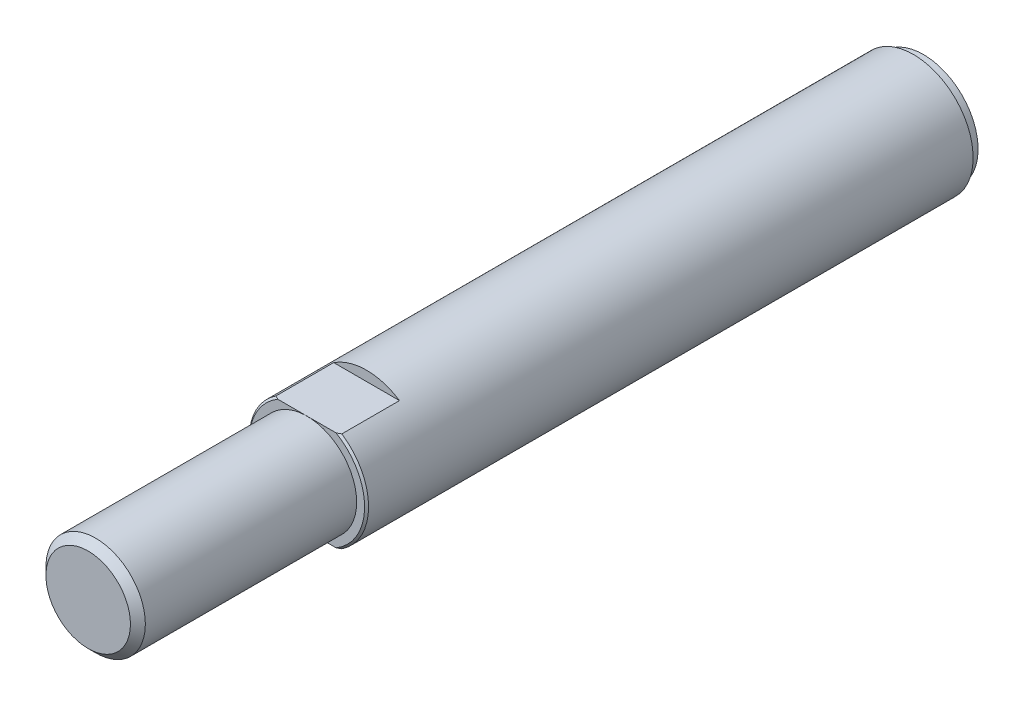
ISO-10303-21;
HEADER;
FILE_DESCRIPTION(('STEP AP214'),'2;1');
FILE_NAME('part.step','',(''),(''),'','','');
FILE_SCHEMA(('AUTOMOTIVE_DESIGN { 1 0 10303 214 1 1 1 1 }'));
ENDSEC;
DATA;
#1=APPLICATION_CONTEXT('core data for automotive mechanical design processes');
#2=APPLICATION_PROTOCOL_DEFINITION('international standard','automotive_design',2000,#1);
#3=PRODUCT_CONTEXT('',#1,'mechanical');
#4=PRODUCT('Part','Part','',(#3));
#5=PRODUCT_RELATED_PRODUCT_CATEGORY('part','',(#4));
#6=PRODUCT_DEFINITION_FORMATION('','',#4);
#7=PRODUCT_DEFINITION_CONTEXT('part definition',#1,'design');
#8=PRODUCT_DEFINITION('design','',#6,#7);
#9=PRODUCT_DEFINITION_SHAPE('','',#8);
#10=(LENGTH_UNIT() NAMED_UNIT(*) SI_UNIT(.MILLI.,.METRE.));
#11=(NAMED_UNIT(*) PLANE_ANGLE_UNIT() SI_UNIT($,.RADIAN.));
#12=(NAMED_UNIT(*) SI_UNIT($,.STERADIAN.) SOLID_ANGLE_UNIT());
#13=UNCERTAINTY_MEASURE_WITH_UNIT(LENGTH_MEASURE(1.E-05),#10,'distance_accuracy_value','');
#14=(GEOMETRIC_REPRESENTATION_CONTEXT(3) GLOBAL_UNCERTAINTY_ASSIGNED_CONTEXT((#13)) GLOBAL_UNIT_ASSIGNED_CONTEXT((#10,
#11,#12)) REPRESENTATION_CONTEXT('',''));
#15=CARTESIAN_POINT('',(0.,0.,0.));
#16=DIRECTION('',(0.,0.,1.));
#17=DIRECTION('',(1.,0.,0.));
#18=AXIS2_PLACEMENT_3D('',#15,#16,#17);
#19=CARTESIAN_POINT('',(0.,0.,84.));
#20=DIRECTION('',(0.,0.,-1.));
#21=DIRECTION('',(-1.,0.,0.));
#22=AXIS2_PLACEMENT_3D('',#19,#20,#21);
#23=CYLINDRICAL_SURFACE('',#22,6.);
#24=CARTESIAN_POINT('',(0.,0.,1.));
#25=DIRECTION('',(0.,0.,-1.));
#26=DIRECTION('',(-1.,0.,0.));
#27=AXIS2_PLACEMENT_3D('',#24,#25,#26);
#28=CIRCLE('',#27,6.);
#29=CARTESIAN_POINT('',(-6.,0.,1.));
#30=VERTEX_POINT('',#29);
#31=EDGE_CURVE('E126',#30,#30,#28,.T.);
#32=ORIENTED_EDGE('',*,*,#31,.F.);
#33=EDGE_LOOP('',(#32));
#34=FACE_BOUND('',#33,.T.);
#35=DIRECTION('',(0.,0.,-1.));
#36=VECTOR('',#35,1.);
#37=CARTESIAN_POINT('',(-3.30907464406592,-5.005,84.));
#38=LINE('',#37,#36);
#39=CARTESIAN_POINT('',(-3.30907464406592,-5.005,61.8000000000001));
#40=VERTEX_POINT('',#39);
#41=CARTESIAN_POINT('',(-3.30907464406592,-5.005,56.));
#42=VERTEX_POINT('',#41);
#43=EDGE_CURVE('E197',#40,#42,#38,.T.);
#44=ORIENTED_EDGE('',*,*,#43,.F.);
#45=CARTESIAN_POINT('',(0.,0.,61.8000000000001));
#46=DIRECTION('',(0.,0.,1.));
#47=DIRECTION('',(1.,0.,0.));
#48=AXIS2_PLACEMENT_3D('',#45,#46,#47);
#49=CIRCLE('',#48,6.);
#50=CARTESIAN_POINT('',(-3.30907464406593,5.005,61.8000000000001));
#51=VERTEX_POINT('',#50);
#52=EDGE_CURVE('E128',#40,#51,#49,.F.);
#53=ORIENTED_EDGE('',*,*,#52,.T.);
#54=DIRECTION('',(0.,0.,-1.));
#55=VECTOR('',#54,1.);
#56=CARTESIAN_POINT('',(-3.30907464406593,5.005,84.));
#57=LINE('',#56,#55);
#58=CARTESIAN_POINT('',(-3.30907464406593,5.005,56.));
#59=VERTEX_POINT('',#58);
#60=EDGE_CURVE('E55',#59,#51,#57,.F.);
#61=ORIENTED_EDGE('',*,*,#60,.F.);
#62=CARTESIAN_POINT('',(0.,0.,56.));
#63=DIRECTION('',(0.,0.,1.));
#64=DIRECTION('',(1.,0.,0.));
#65=AXIS2_PLACEMENT_3D('',#62,#63,#64);
#66=CIRCLE('',#65,6.);
#67=CARTESIAN_POINT('',(3.30907464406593,5.005,56.));
#68=VERTEX_POINT('',#67);
#69=EDGE_CURVE('E44',#68,#59,#66,.T.);
#70=ORIENTED_EDGE('',*,*,#69,.F.);
#71=DIRECTION('',(0.,0.,-1.));
#72=VECTOR('',#71,1.);
#73=CARTESIAN_POINT('',(3.30907464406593,5.005,84.));
#74=LINE('',#73,#72);
#75=CARTESIAN_POINT('',(3.30907464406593,5.005,61.8000000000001));
#76=VERTEX_POINT('',#75);
#77=EDGE_CURVE('E206',#76,#68,#74,.T.);
#78=ORIENTED_EDGE('',*,*,#77,.F.);
#79=CARTESIAN_POINT('',(3.30907464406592,-5.005,61.8000000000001));
#80=VERTEX_POINT('',#79);
#81=EDGE_CURVE('E113',#76,#80,#49,.F.);
#82=ORIENTED_EDGE('',*,*,#81,.T.);
#83=DIRECTION('',(0.,0.,-1.));
#84=VECTOR('',#83,1.);
#85=CARTESIAN_POINT('',(3.30907464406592,-5.005,84.));
#86=LINE('',#85,#84);
#87=CARTESIAN_POINT('',(3.30907464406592,-5.005,56.));
#88=VERTEX_POINT('',#87);
#89=EDGE_CURVE('E63',#88,#80,#86,.F.);
#90=ORIENTED_EDGE('',*,*,#89,.F.);
#91=EDGE_CURVE('E12',#42,#88,#66,.T.);
#92=ORIENTED_EDGE('',*,*,#91,.F.);
#93=EDGE_LOOP('',(#44,#53,#61,#70,#78,#82,#90,#92));
#94=FACE_BOUND('',#93,.T.);
#95=ADVANCED_FACE('F40',(#34,#94),#23,.T.);
#96=CARTESIAN_POINT('',(0.,0.,62.));
#97=DIRECTION('',(0.,0.,1.));
#98=DIRECTION('',(1.,0.,0.));
#99=AXIS2_PLACEMENT_3D('',#96,#97,#98);
#100=PLANE('',#99);
#101=CARTESIAN_POINT('',(0.,0.,62.));
#102=DIRECTION('',(0.,0.,1.));
#103=DIRECTION('',(1.,0.,0.));
#104=AXIS2_PLACEMENT_3D('',#101,#102,#103);
#105=CIRCLE('',#104,5.);
#106=CARTESIAN_POINT('',(5.,0.,62.));
#107=VERTEX_POINT('',#106);
#108=EDGE_CURVE('E119',#107,#107,#105,.T.);
#109=ORIENTED_EDGE('',*,*,#108,.F.);
#110=EDGE_LOOP('',(#109));
#111=FACE_BOUND('',#110,.T.);
#112=CARTESIAN_POINT('',(0.,0.,62.));
#113=DIRECTION('',(0.,0.,1.));
#114=DIRECTION('',(1.,0.,0.));
#115=AXIS2_PLACEMENT_3D('',#112,#113,#114);
#116=CIRCLE('',#115,5.80000000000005);
#117=CARTESIAN_POINT('',(-2.93086591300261,5.005,62.));
#118=VERTEX_POINT('',#117);
#119=CARTESIAN_POINT('',(-2.93086591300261,-5.005,62.));
#120=VERTEX_POINT('',#119);
#121=EDGE_CURVE('E118',#118,#120,#116,.T.);
#122=ORIENTED_EDGE('',*,*,#121,.T.);
#123=DIRECTION('',(1.,0.,0.));
#124=VECTOR('',#123,1.);
#125=CARTESIAN_POINT('',(-8.78582064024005,-5.005,62.));
#126=LINE('',#125,#124);
#127=CARTESIAN_POINT('',(2.93086591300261,-5.005,62.));
#128=VERTEX_POINT('',#127);
#129=EDGE_CURVE('E105',#120,#128,#126,.T.);
#130=ORIENTED_EDGE('',*,*,#129,.T.);
#131=CARTESIAN_POINT('',(2.93086591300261,5.005,62.));
#132=VERTEX_POINT('',#131);
#133=EDGE_CURVE('E111',#128,#132,#116,.T.);
#134=ORIENTED_EDGE('',*,*,#133,.T.);
#135=DIRECTION('',(-1.,0.,0.));
#136=VECTOR('',#135,1.);
#137=CARTESIAN_POINT('',(-8.78582064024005,5.005,62.));
#138=LINE('',#137,#136);
#139=EDGE_CURVE('E95',#132,#118,#138,.T.);
#140=ORIENTED_EDGE('',*,*,#139,.T.);
#141=EDGE_LOOP('',(#122,#130,#134,#140));
#142=FACE_BOUND('',#141,.T.);
#143=ADVANCED_FACE('F117',(#111,#142),#100,.T.);
#144=CARTESIAN_POINT('',(0.,0.,62.));
#145=DIRECTION('',(0.,0.,-1.));
#146=DIRECTION('',(-1.,0.,0.));
#147=AXIS2_PLACEMENT_3D('',#144,#145,#146);
#148=CONICAL_SURFACE('',#147,5.80000000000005,0.785398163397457);
#149=ORIENTED_EDGE('',*,*,#52,.F.);
#150=CARTESIAN_POINT('',(-12.2156315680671,-5.005,54.5988000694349));
#151=CARTESIAN_POINT('',(-12.0324999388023,-5.005,54.7682565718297));
#152=CARTESIAN_POINT('',(-11.8490986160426,-5.005,54.9374214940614));
#153=CARTESIAN_POINT('',(-11.4816757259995,-5.005,55.2750789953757));
#154=CARTESIAN_POINT('',(-11.2976541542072,-5.005,55.4435715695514));
#155=CARTESIAN_POINT('',(-10.7444624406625,-5.005,55.9479756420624));
#156=CARTESIAN_POINT('',(-10.3742440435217,-5.005,56.282740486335));
#157=CARTESIAN_POINT('',(-9.6279368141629,-5.005,56.9501555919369));
#158=CARTESIAN_POINT('',(-9.25182618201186,-5.005,57.2827815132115));
#159=CARTESIAN_POINT('',(-8.49465654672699,-5.005,57.9422890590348));
#160=CARTESIAN_POINT('',(-8.11359812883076,-5.005,58.2691713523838));
#161=CARTESIAN_POINT('',(-7.42089221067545,-5.005,58.8506034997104));
#162=CARTESIAN_POINT('',(-7.11048533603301,-5.005,59.1066285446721));
#163=CARTESIAN_POINT('',(-6.48364770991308,-5.005,59.6114120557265));
#164=CARTESIAN_POINT('',(-6.16721553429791,-5.005,59.8601687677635));
#165=CARTESIAN_POINT('',(-5.68667671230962,-5.005,60.2252005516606));
#166=CARTESIAN_POINT('',(-5.52560212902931,-5.005,60.3454657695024));
#167=CARTESIAN_POINT('',(-5.2010734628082,-5.005,60.5827357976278));
#168=CARTESIAN_POINT('',(-5.03761949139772,-5.005,60.6997407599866));
#169=CARTESIAN_POINT('',(-4.70796827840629,-5.005,60.929698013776));
#170=CARTESIAN_POINT('',(-4.54177210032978,-5.005,61.0426518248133));
#171=CARTESIAN_POINT('',(-4.20609120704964,-5.005,61.263544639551));
#172=CARTESIAN_POINT('',(-4.03660686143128,-5.005,61.3714842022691));
#173=CARTESIAN_POINT('',(-3.69747651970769,-5.005,61.5787672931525));
#174=CARTESIAN_POINT('',(-3.52791396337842,-5.005,61.6782465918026));
#175=CARTESIAN_POINT('',(-3.18445645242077,-5.005,61.8695330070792));
#176=CARTESIAN_POINT('',(-3.01056101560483,-5.005,61.961339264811));
#177=CARTESIAN_POINT('',(-2.65800152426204,-5.005,62.1350655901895));
#178=CARTESIAN_POINT('',(-2.47934076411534,-5.005,62.2169922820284));
#179=CARTESIAN_POINT('',(-2.11674859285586,-5.005,62.3682840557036));
#180=CARTESIAN_POINT('',(-1.93281870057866,-5.005,62.4376527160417));
#181=CARTESIAN_POINT('',(-1.60060436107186,-5.005,62.5470903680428));
#182=CARTESIAN_POINT('',(-1.45334347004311,-5.005,62.5902487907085));
#183=CARTESIAN_POINT('',(-1.15594747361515,-5.005,62.6652599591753));
#184=CARTESIAN_POINT('',(-1.00581273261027,-5.005,62.6971141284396));
#185=CARTESIAN_POINT('',(-0.703846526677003,-5.005,62.7479346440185));
#186=CARTESIAN_POINT('',(-0.552022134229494,-5.005,62.7669424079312));
#187=CARTESIAN_POINT('',(-0.247267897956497,-5.005,62.7911969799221));
#188=CARTESIAN_POINT('',(-0.0943381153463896,-5.005,62.7964445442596));
#189=CARTESIAN_POINT('',(0.211741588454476,-5.005,62.7928669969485));
#190=CARTESIAN_POINT('',(0.364891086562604,-5.005,62.7840062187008));
#191=CARTESIAN_POINT('',(0.669778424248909,-5.005,62.752662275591));
#192=CARTESIAN_POINT('',(0.821516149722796,-5.005,62.730178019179));
#193=CARTESIAN_POINT('',(1.12305638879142,-5.005,62.6726918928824));
#194=CARTESIAN_POINT('',(1.2728514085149,-5.005,62.6376512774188));
#195=CARTESIAN_POINT('',(1.56942422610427,-5.005,62.5566468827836));
#196=CARTESIAN_POINT('',(1.71620190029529,-5.005,62.5106826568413));
#197=CARTESIAN_POINT('',(2.02423602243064,-5.005,62.4033126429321));
#198=CARTESIAN_POINT('',(2.1850705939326,-5.005,62.3407063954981));
#199=CARTESIAN_POINT('',(2.50272024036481,-5.005,62.2059917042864));
#200=CARTESIAN_POINT('',(2.65953406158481,-5.005,62.1338803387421));
#201=CARTESIAN_POINT('',(2.96965319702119,-5.005,61.9818761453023));
#202=CARTESIAN_POINT('',(3.12295193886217,-5.005,61.9019700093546));
#203=CARTESIAN_POINT('',(3.4261235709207,-5.005,61.7359862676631));
#204=CARTESIAN_POINT('',(3.57599689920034,-5.005,61.6499094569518));
#205=CARTESIAN_POINT('',(3.87459476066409,-5.005,61.4716525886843));
#206=CARTESIAN_POINT('',(4.02328169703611,-5.005,61.379409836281));
#207=CARTESIAN_POINT('',(4.31797697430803,-5.005,61.1907514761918));
#208=CARTESIAN_POINT('',(4.46398525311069,-5.005,61.0943357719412));
#209=CARTESIAN_POINT('',(4.89825111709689,-5.005,60.800188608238));
#210=CARTESIAN_POINT('',(5.18305932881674,-5.005,60.5973679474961));
#211=CARTESIAN_POINT('',(5.7712423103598,-5.005,60.1636109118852));
#212=CARTESIAN_POINT('',(6.07395942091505,-5.005,59.9317925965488));
#213=CARTESIAN_POINT('',(6.67332064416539,-5.005,59.4603929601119));
#214=CARTESIAN_POINT('',(6.96996397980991,-5.005,59.2208106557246));
#215=CARTESIAN_POINT('',(7.55888505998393,-5.005,58.7358462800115));
#216=CARTESIAN_POINT('',(7.85115878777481,-5.005,58.4904593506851));
#217=CARTESIAN_POINT('',(8.43214987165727,-5.005,57.9955080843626));
#218=CARTESIAN_POINT('',(8.72086714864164,-5.005,57.7459436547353));
#219=CARTESIAN_POINT('',(9.27957846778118,-5.005,57.2575498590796));
#220=CARTESIAN_POINT('',(9.54972310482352,-5.005,57.0188924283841));
#221=CARTESIAN_POINT('',(10.0880057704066,-5.005,56.5393178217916));
#222=CARTESIAN_POINT('',(10.3561437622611,-5.005,56.2984006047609));
#223=CARTESIAN_POINT('',(10.8902828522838,-5.005,55.8152045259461));
#224=CARTESIAN_POINT('',(11.1562869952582,-5.005,55.5729290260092));
#225=CARTESIAN_POINT('',(11.6869202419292,-5.005,55.0868982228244));
#226=CARTESIAN_POINT('',(11.9515494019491,-5.005,54.8431429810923));
#227=CARTESIAN_POINT('',(12.2156315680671,-5.005,54.5988000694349));
#228=B_SPLINE_CURVE_WITH_KNOTS('',3,(#150,#151,#152,#153,#154,#155,#156,#157,#158,#159,#160,
#161,#162,#163,#164,#165,#166,#167,#168,#169,#170,#171,#172,#173,#174,#175,#176,#177,#178,#179,
#180,#181,#182,#183,#184,#185,#186,#187,#188,#189,#190,#191,#192,#193,#194,#195,#196,#197,#198,
#199,#200,#201,#202,#203,#204,#205,#206,#207,#208,#209,#210,#211,#212,#213,#214,#215,#216,#217,
#218,#219,#220,#221,#222,#223,#224,#225,#226,#227),.UNSPECIFIED.,.F.,.F.,(4,2,2,2,2,2,2,2,2,2,2,
2,2,2,2,2,2,2,2,2,2,2,2,2,2,2,2,2,2,2,2,2,2,2,2,2,2,2,4),(0.,0.748514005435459,1.49703346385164,
2.99439450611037,4.50064193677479,6.00671279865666,7.21375256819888,8.42108126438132,
9.02410779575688,9.62710615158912,10.2298759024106,10.8325782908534,11.4221921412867,
12.011871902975,12.6011540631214,13.1902680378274,13.6502553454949,14.1101847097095,
14.5686240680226,15.0270382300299,15.4866131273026,15.9462248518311,16.4072672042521,
16.8683284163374,17.38571783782,17.903266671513,18.4217151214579,18.9400968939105,
19.4649392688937,19.9897937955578,21.0384156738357,22.1821055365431,23.3259408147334,
24.4707698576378,25.6156243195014,26.6970061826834,27.7784077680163,28.8578000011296,
29.9371476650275),.UNSPECIFIED.);
#229=EDGE_CURVE('E204',#40,#120,#228,.T.);
#230=ORIENTED_EDGE('',*,*,#229,.T.);
#231=ORIENTED_EDGE('',*,*,#121,.F.);
#232=CARTESIAN_POINT('',(12.2156315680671,5.005,54.5988000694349));
#233=CARTESIAN_POINT('',(12.0324999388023,5.005,54.7682565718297));
#234=CARTESIAN_POINT('',(11.8490986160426,5.005,54.9374214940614));
#235=CARTESIAN_POINT('',(11.4816757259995,5.005,55.2750789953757));
#236=CARTESIAN_POINT('',(11.2976541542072,5.005,55.4435715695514));
#237=CARTESIAN_POINT('',(10.7444624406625,5.005,55.9479756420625));
#238=CARTESIAN_POINT('',(10.3742440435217,5.005,56.282740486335));
#239=CARTESIAN_POINT('',(9.6279368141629,5.005,56.9501555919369));
#240=CARTESIAN_POINT('',(9.25182618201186,5.005,57.2827815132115));
#241=CARTESIAN_POINT('',(8.49465654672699,5.005,57.9422890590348));
#242=CARTESIAN_POINT('',(8.11359812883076,5.005,58.2691713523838));
#243=CARTESIAN_POINT('',(7.42089221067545,5.005,58.8506034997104));
#244=CARTESIAN_POINT('',(7.11048533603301,5.005,59.1066285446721));
#245=CARTESIAN_POINT('',(6.48364770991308,5.005,59.6114120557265));
#246=CARTESIAN_POINT('',(6.16721553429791,5.005,59.8601687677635));
#247=CARTESIAN_POINT('',(5.68667671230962,5.005,60.2252005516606));
#248=CARTESIAN_POINT('',(5.52560212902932,5.005,60.3454657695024));
#249=CARTESIAN_POINT('',(5.20107346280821,5.005,60.5827357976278));
#250=CARTESIAN_POINT('',(5.03761949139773,5.005,60.6997407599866));
#251=CARTESIAN_POINT('',(4.7079682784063,5.005,60.929698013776));
#252=CARTESIAN_POINT('',(4.54177210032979,5.005,61.0426518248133));
#253=CARTESIAN_POINT('',(4.20609120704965,5.005,61.263544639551));
#254=CARTESIAN_POINT('',(4.0366068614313,5.005,61.3714842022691));
#255=CARTESIAN_POINT('',(3.69747651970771,5.005,61.5787672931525));
#256=CARTESIAN_POINT('',(3.52791396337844,5.005,61.6782465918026));
#257=CARTESIAN_POINT('',(3.18445645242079,5.005,61.8695330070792));
#258=CARTESIAN_POINT('',(3.01056101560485,5.005,61.961339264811));
#259=CARTESIAN_POINT('',(2.65800152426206,5.005,62.1350655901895));
#260=CARTESIAN_POINT('',(2.47934076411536,5.005,62.2169922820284));
#261=CARTESIAN_POINT('',(2.11674859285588,5.005,62.3682840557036));
#262=CARTESIAN_POINT('',(1.93281870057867,5.005,62.4376527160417));
#263=CARTESIAN_POINT('',(1.60060436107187,5.005,62.5470903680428));
#264=CARTESIAN_POINT('',(1.45334347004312,5.005,62.5902487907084));
#265=CARTESIAN_POINT('',(1.15594747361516,5.005,62.6652599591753));
#266=CARTESIAN_POINT('',(1.00581273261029,5.005,62.6971141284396));
#267=CARTESIAN_POINT('',(0.703846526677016,5.005,62.7479346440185));
#268=CARTESIAN_POINT('',(0.552022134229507,5.005,62.7669424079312));
#269=CARTESIAN_POINT('',(0.24726789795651,5.005,62.7911969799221));
#270=CARTESIAN_POINT('',(0.0943381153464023,5.005,62.7964445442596));
#271=CARTESIAN_POINT('',(-0.211741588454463,5.005,62.7928669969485));
#272=CARTESIAN_POINT('',(-0.364891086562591,5.005,62.7840062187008));
#273=CARTESIAN_POINT('',(-0.669778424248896,5.005,62.752662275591));
#274=CARTESIAN_POINT('',(-0.821516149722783,5.005,62.730178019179));
#275=CARTESIAN_POINT('',(-1.12305638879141,5.005,62.6726918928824));
#276=CARTESIAN_POINT('',(-1.27285140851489,5.005,62.6376512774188));
#277=CARTESIAN_POINT('',(-1.56942422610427,5.005,62.5566468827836));
#278=CARTESIAN_POINT('',(-1.71620190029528,5.005,62.5106826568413));
#279=CARTESIAN_POINT('',(-2.02423602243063,5.005,62.4033126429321));
#280=CARTESIAN_POINT('',(-2.18507059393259,5.005,62.3407063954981));
#281=CARTESIAN_POINT('',(-2.50272024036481,5.005,62.2059917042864));
#282=CARTESIAN_POINT('',(-2.6595340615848,5.005,62.1338803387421));
#283=CARTESIAN_POINT('',(-2.96965319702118,5.005,61.9818761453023));
#284=CARTESIAN_POINT('',(-3.12295193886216,5.005,61.9019700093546));
#285=CARTESIAN_POINT('',(-3.42612357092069,5.005,61.7359862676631));
#286=CARTESIAN_POINT('',(-3.57599689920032,5.005,61.6499094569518));
#287=CARTESIAN_POINT('',(-3.87459476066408,5.005,61.4716525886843));
#288=CARTESIAN_POINT('',(-4.0232816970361,5.005,61.379409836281));
#289=CARTESIAN_POINT('',(-4.31797697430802,5.005,61.1907514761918));
#290=CARTESIAN_POINT('',(-4.46398525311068,5.005,61.0943357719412));
#291=CARTESIAN_POINT('',(-4.89825111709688,5.005,60.800188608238));
#292=CARTESIAN_POINT('',(-5.18305932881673,5.005,60.5973679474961));
#293=CARTESIAN_POINT('',(-5.77124231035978,5.005,60.1636109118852));
#294=CARTESIAN_POINT('',(-6.07395942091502,5.005,59.9317925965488));
#295=CARTESIAN_POINT('',(-6.67332064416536,5.005,59.4603929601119));
#296=CARTESIAN_POINT('',(-6.96996397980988,5.005,59.2208106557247));
#297=CARTESIAN_POINT('',(-7.5588850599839,5.005,58.7358462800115));
#298=CARTESIAN_POINT('',(-7.8511587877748,5.005,58.4904593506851));
#299=CARTESIAN_POINT('',(-8.43214987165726,5.005,57.9955080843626));
#300=CARTESIAN_POINT('',(-8.72086714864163,5.005,57.7459436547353));
#301=CARTESIAN_POINT('',(-9.27957846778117,5.005,57.2575498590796));
#302=CARTESIAN_POINT('',(-9.54972310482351,5.005,57.0188924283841));
#303=CARTESIAN_POINT('',(-10.0880057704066,5.005,56.5393178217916));
#304=CARTESIAN_POINT('',(-10.3561437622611,5.005,56.2984006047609));
#305=CARTESIAN_POINT('',(-10.8902828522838,5.005,55.8152045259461));
#306=CARTESIAN_POINT('',(-11.1562869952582,5.005,55.5729290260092));
#307=CARTESIAN_POINT('',(-11.6869202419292,5.005,55.0868982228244));
#308=CARTESIAN_POINT('',(-11.9515494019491,5.005,54.8431429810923));
#309=CARTESIAN_POINT('',(-12.2156315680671,5.005,54.5988000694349));
#310=B_SPLINE_CURVE_WITH_KNOTS('',3,(#232,#233,#234,#235,#236,#237,#238,#239,#240,#241,#242,
#243,#244,#245,#246,#247,#248,#249,#250,#251,#252,#253,#254,#255,#256,#257,#258,#259,#260,#261,
#262,#263,#264,#265,#266,#267,#268,#269,#270,#271,#272,#273,#274,#275,#276,#277,#278,#279,#280,
#281,#282,#283,#284,#285,#286,#287,#288,#289,#290,#291,#292,#293,#294,#295,#296,#297,#298,#299,
#300,#301,#302,#303,#304,#305,#306,#307,#308,#309),.UNSPECIFIED.,.F.,.F.,(4,2,2,2,2,2,2,2,2,2,2,
2,2,2,2,2,2,2,2,2,2,2,2,2,2,2,2,2,2,2,2,2,2,2,2,2,2,2,4),(0.,0.748514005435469,1.49703346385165,
2.99439450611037,4.50064193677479,6.00671279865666,7.21375256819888,8.42108126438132,
9.02410779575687,9.62710615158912,10.2298759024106,10.8325782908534,11.4221921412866,
12.011871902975,12.6011540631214,13.1902680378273,13.6502553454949,14.1101847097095,
14.5686240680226,15.0270382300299,15.4866131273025,15.9462248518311,16.4072672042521,
16.8683284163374,17.38571783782,17.9032666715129,18.4217151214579,18.9400968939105,
19.4649392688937,19.9897937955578,21.0384156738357,22.182105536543,23.3259408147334,
24.4707698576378,25.6156243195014,26.6970061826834,27.7784077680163,28.8578000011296,
29.9371476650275),.UNSPECIFIED.);
#311=EDGE_CURVE('E100',#118,#51,#310,.T.);
#312=ORIENTED_EDGE('',*,*,#311,.T.);
#313=EDGE_LOOP('',(#149,#230,#231,#312));
#314=FACE_BOUND('',#313,.T.);
#315=ADVANCED_FACE('F144',(#314),#148,.T.);
#316=ORIENTED_EDGE('',*,*,#133,.F.);
#317=EDGE_CURVE('E114',#128,#80,#228,.T.);
#318=ORIENTED_EDGE('',*,*,#317,.T.);
#319=ORIENTED_EDGE('',*,*,#81,.F.);
#320=EDGE_CURVE('E98',#76,#132,#310,.T.);
#321=ORIENTED_EDGE('',*,*,#320,.T.);
#322=EDGE_LOOP('',(#316,#318,#319,#321));
#323=FACE_BOUND('',#322,.T.);
#324=ADVANCED_FACE('F110',(#323),#148,.T.);
#325=CARTESIAN_POINT('',(0.,0.,62.));
#326=DIRECTION('',(0.,0.,1.));
#327=DIRECTION('',(1.,0.,0.));
#328=AXIS2_PLACEMENT_3D('',#325,#326,#327);
#329=CYLINDRICAL_SURFACE('',#328,5.);
#330=CARTESIAN_POINT('',(0.,0.,83.25));
#331=DIRECTION('',(0.,0.,1.));
#332=DIRECTION('',(1.,0.,0.));
#333=AXIS2_PLACEMENT_3D('',#330,#331,#332);
#334=CIRCLE('',#333,5.);
#335=CARTESIAN_POINT('',(5.,0.,83.25));
#336=VERTEX_POINT('',#335);
#337=EDGE_CURVE('E132',#336,#336,#334,.F.);
#338=ORIENTED_EDGE('',*,*,#337,.T.);
#339=EDGE_LOOP('',(#338));
#340=FACE_BOUND('',#339,.T.);
#341=ORIENTED_EDGE('',*,*,#108,.T.);
#342=EDGE_LOOP('',(#341));
#343=FACE_BOUND('',#342,.T.);
#344=ADVANCED_FACE('F175',(#340,#343),#329,.T.);
#345=CARTESIAN_POINT('',(0.,0.,84.));
#346=DIRECTION('',(0.,0.,1.));
#347=DIRECTION('',(1.,0.,0.));
#348=AXIS2_PLACEMENT_3D('',#345,#346,#347);
#349=PLANE('',#348);
#350=CARTESIAN_POINT('',(0.,0.,84.));
#351=DIRECTION('',(0.,0.,1.));
#352=DIRECTION('',(1.,0.,0.));
#353=AXIS2_PLACEMENT_3D('',#350,#351,#352);
#354=CIRCLE('',#353,4.25);
#355=CARTESIAN_POINT('',(4.25,0.,84.));
#356=VERTEX_POINT('',#355);
#357=EDGE_CURVE('E129',#356,#356,#354,.T.);
#358=ORIENTED_EDGE('',*,*,#357,.T.);
#359=EDGE_LOOP('',(#358));
#360=FACE_BOUND('',#359,.T.);
#361=ADVANCED_FACE('F165',(#360),#349,.T.);
#362=CARTESIAN_POINT('',(0.,0.,1.));
#363=DIRECTION('',(0.,0.,-1.));
#364=DIRECTION('',(-1.,0.,0.));
#365=AXIS2_PLACEMENT_3D('',#362,#363,#364);
#366=PLANE('',#365);
#367=CARTESIAN_POINT('',(0.,0.,1.));
#368=DIRECTION('',(0.,0.,-1.));
#369=DIRECTION('',(-1.,0.,0.));
#370=AXIS2_PLACEMENT_3D('',#367,#368,#369);
#371=CIRCLE('',#370,5.5);
#372=CARTESIAN_POINT('',(-5.5,0.,1.));
#373=VERTEX_POINT('',#372);
#374=EDGE_CURVE('E214',#373,#373,#371,.T.);
#375=ORIENTED_EDGE('',*,*,#374,.F.);
#376=EDGE_LOOP('',(#375));
#377=FACE_BOUND('',#376,.T.);
#378=ORIENTED_EDGE('',*,*,#31,.T.);
#379=EDGE_LOOP('',(#378));
#380=FACE_BOUND('',#379,.T.);
#381=ADVANCED_FACE('F161',(#377,#380),#366,.T.);
#382=CARTESIAN_POINT('',(0.,0.,1.));
#383=DIRECTION('',(0.,0.,-1.));
#384=DIRECTION('',(-1.,0.,0.));
#385=AXIS2_PLACEMENT_3D('',#382,#383,#384);
#386=CYLINDRICAL_SURFACE('',#385,5.5);
#387=ORIENTED_EDGE('',*,*,#374,.T.);
#388=EDGE_LOOP('',(#387));
#389=FACE_BOUND('',#388,.T.);
#390=CARTESIAN_POINT('',(0.,0.,0.));
#391=DIRECTION('',(0.,0.,-1.));
#392=DIRECTION('',(-1.,0.,0.));
#393=AXIS2_PLACEMENT_3D('',#390,#391,#392);
#394=CIRCLE('',#393,5.5);
#395=CARTESIAN_POINT('',(-5.5,0.,0.));
#396=VERTEX_POINT('',#395);
#397=EDGE_CURVE('E200',#396,#396,#394,.T.);
#398=ORIENTED_EDGE('',*,*,#397,.F.);
#399=EDGE_LOOP('',(#398));
#400=FACE_BOUND('',#399,.T.);
#401=ADVANCED_FACE('F157',(#389,#400),#386,.T.);
#402=CARTESIAN_POINT('',(0.,0.,17.));
#403=DIRECTION('',(0.,0.,-1.));
#404=DIRECTION('',(-1.,0.,0.));
#405=AXIS2_PLACEMENT_3D('',#402,#403,#404);
#406=CONICAL_SURFACE('',#405,2.49999999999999,1.02974425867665);
#407=CARTESIAN_POINT('',(0.,0.,18.5021515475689));
#408=VERTEX_POINT('',#407);
#409=VERTEX_LOOP('',#408);
#410=FACE_BOUND('',#409,.T.);
#411=CARTESIAN_POINT('',(0.,0.,17.));
#412=DIRECTION('',(0.,0.,-1.));
#413=DIRECTION('',(-1.,0.,0.));
#414=AXIS2_PLACEMENT_3D('',#411,#412,#413);
#415=CIRCLE('',#414,2.49999999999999);
#416=CARTESIAN_POINT('',(-2.49999999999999,0.,17.));
#417=VERTEX_POINT('',#416);
#418=EDGE_CURVE('E122',#417,#417,#415,.T.);
#419=ORIENTED_EDGE('',*,*,#418,.T.);
#420=EDGE_LOOP('',(#419));
#421=FACE_BOUND('',#420,.T.);
#422=ADVANCED_FACE('F160',(#410,#421),#406,.F.);
#423=CARTESIAN_POINT('',(0.,0.,0.));
#424=DIRECTION('',(0.,0.,-1.));
#425=DIRECTION('',(-1.,0.,0.));
#426=AXIS2_PLACEMENT_3D('',#423,#424,#425);
#427=CYLINDRICAL_SURFACE('',#426,2.49999999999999);
#428=ORIENTED_EDGE('',*,*,#418,.F.);
#429=EDGE_LOOP('',(#428));
#430=FACE_BOUND('',#429,.T.);
#431=CARTESIAN_POINT('',(0.,0.,0.));
#432=DIRECTION('',(0.,0.,-1.));
#433=DIRECTION('',(-1.,0.,0.));
#434=AXIS2_PLACEMENT_3D('',#431,#432,#433);
#435=CIRCLE('',#434,2.49999999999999);
#436=CARTESIAN_POINT('',(-2.49999999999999,0.,0.));
#437=VERTEX_POINT('',#436);
#438=EDGE_CURVE('E219',#437,#437,#435,.T.);
#439=ORIENTED_EDGE('',*,*,#438,.T.);
#440=EDGE_LOOP('',(#439));
#441=FACE_BOUND('',#440,.T.);
#442=ADVANCED_FACE('F167',(#430,#441),#427,.F.);
#443=CARTESIAN_POINT('',(0.,0.,0.));
#444=DIRECTION('',(0.,0.,1.));
#445=DIRECTION('',(1.,0.,0.));
#446=AXIS2_PLACEMENT_3D('',#443,#444,#445);
#447=PLANE('',#446);
#448=ORIENTED_EDGE('',*,*,#438,.F.);
#449=EDGE_LOOP('',(#448));
#450=FACE_BOUND('',#449,.T.);
#451=ORIENTED_EDGE('',*,*,#397,.T.);
#452=EDGE_LOOP('',(#451));
#453=FACE_BOUND('',#452,.T.);
#454=ADVANCED_FACE('F170',(#450,#453),#447,.F.);
#455=CARTESIAN_POINT('',(0.,0.,84.));
#456=DIRECTION('',(0.,0.,-1.));
#457=DIRECTION('',(-1.,0.,0.));
#458=AXIS2_PLACEMENT_3D('',#455,#456,#457);
#459=CONICAL_SURFACE('',#458,4.25,0.785398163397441);
#460=ORIENTED_EDGE('',*,*,#337,.F.);
#461=EDGE_LOOP('',(#460));
#462=FACE_BOUND('',#461,.T.);
#463=ORIENTED_EDGE('',*,*,#357,.F.);
#464=EDGE_LOOP('',(#463));
#465=FACE_BOUND('',#464,.T.);
#466=ADVANCED_FACE('F42',(#462,#465),#459,.T.);
#467=CARTESIAN_POINT('',(-8.78582064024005,5.005,56.));
#468=DIRECTION('',(0.,1.,0.));
#469=DIRECTION('',(0.,0.,1.));
#470=AXIS2_PLACEMENT_3D('',#467,#468,#469);
#471=PLANE('',#470);
#472=ORIENTED_EDGE('',*,*,#77,.T.);
#473=DIRECTION('',(-1.,0.,0.));
#474=VECTOR('',#473,1.);
#475=CARTESIAN_POINT('',(-8.78582064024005,5.005,56.));
#476=LINE('',#475,#474);
#477=EDGE_CURVE('E232',#68,#59,#476,.T.);
#478=ORIENTED_EDGE('',*,*,#477,.T.);
#479=ORIENTED_EDGE('',*,*,#60,.T.);
#480=ORIENTED_EDGE('',*,*,#311,.F.);
#481=ORIENTED_EDGE('',*,*,#139,.F.);
#482=ORIENTED_EDGE('',*,*,#320,.F.);
#483=EDGE_LOOP('',(#472,#478,#479,#480,#481,#482));
#484=FACE_BOUND('',#483,.T.);
#485=ADVANCED_FACE('F97',(#484),#471,.T.);
#486=CARTESIAN_POINT('',(0.,0.,56.));
#487=DIRECTION('',(0.,0.,1.));
#488=DIRECTION('',(1.,0.,0.));
#489=AXIS2_PLACEMENT_3D('',#486,#487,#488);
#490=PLANE('',#489);
#491=ORIENTED_EDGE('',*,*,#69,.T.);
#492=ORIENTED_EDGE('',*,*,#477,.F.);
#493=EDGE_LOOP('',(#491,#492));
#494=FACE_BOUND('',#493,.T.);
#495=ADVANCED_FACE('F150',(#494),#490,.T.);
#496=ORIENTED_EDGE('',*,*,#91,.T.);
#497=DIRECTION('',(1.,0.,0.));
#498=VECTOR('',#497,1.);
#499=CARTESIAN_POINT('',(-8.78582064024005,-5.005,56.));
#500=LINE('',#499,#498);
#501=EDGE_CURVE('E210',#42,#88,#500,.T.);
#502=ORIENTED_EDGE('',*,*,#501,.F.);
#503=EDGE_LOOP('',(#496,#502));
#504=FACE_BOUND('',#503,.T.);
#505=ADVANCED_FACE('F155',(#504),#490,.T.);
#506=CARTESIAN_POINT('',(-8.78582064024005,-5.005,56.));
#507=DIRECTION('',(0.,-1.,0.));
#508=DIRECTION('',(0.,0.,-1.));
#509=AXIS2_PLACEMENT_3D('',#506,#507,#508);
#510=PLANE('',#509);
#511=ORIENTED_EDGE('',*,*,#43,.T.);
#512=ORIENTED_EDGE('',*,*,#501,.T.);
#513=ORIENTED_EDGE('',*,*,#89,.T.);
#514=ORIENTED_EDGE('',*,*,#317,.F.);
#515=ORIENTED_EDGE('',*,*,#129,.F.);
#516=ORIENTED_EDGE('',*,*,#229,.F.);
#517=EDGE_LOOP('',(#511,#512,#513,#514,#515,#516));
#518=FACE_BOUND('',#517,.T.);
#519=ADVANCED_FACE('F151',(#518),#510,.T.);
#520=CLOSED_SHELL('',(#95,#143,#315,#324,#344,#361,#381,#401,#422,#442,#454,#466,#485,#495,#505,#519));
#521=MANIFOLD_SOLID_BREP('B2',#520);
#522=ADVANCED_BREP_SHAPE_REPRESENTATION('',(#18,#521),#14);
#523=SHAPE_DEFINITION_REPRESENTATION(#9,#522);
ENDSEC;
END-ISO-10303-21;
